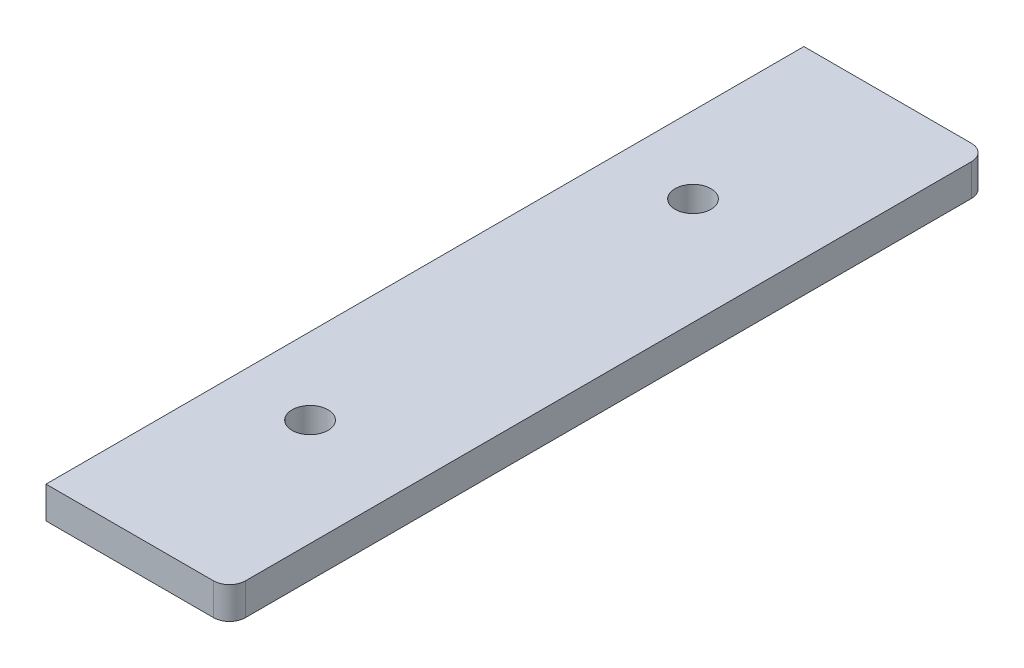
from build123d import *

# Parameters (mm, degrees)
SKETCH2_W           = 36.5125
SKETCH2_H           = 150.8125
SKETCH2_R           = 3.571875
BOSS_EXTRUDE1_DEPTH = 6.35
FILLET1_R           = 3.175


with BuildPart() as part:
    # Sketch2 → Boss-Extrude1 (new body)
    with BuildSketch(Plane(origin=(0, 0, 0), x_dir=(1, 0, 0), z_dir=(0, 1, 0))):
        Rectangle(SKETCH2_W, SKETCH2_H)
        with Locations(Location((-3.01625, 38.1, 0), (0, 0, 270))):
            Circle(SKETCH2_R, mode=Mode.SUBTRACT)
        with Locations(Location((-3.01625, -38.1, 0), (0, 0, 270))):
            Circle(SKETCH2_R, mode=Mode.SUBTRACT)
    extrude(amount=BOSS_EXTRUDE1_DEPTH)

    # Fillet1
    fillet1_edges = [part.edges().sort_by_distance(p)[0] for p in [
        (18.25625, 3.175, 75.40625),
        (18.25625, 3.175, -75.40625),
    ]]
    fillet(fillet1_edges, radius=FILLET1_R)


solid = part.part
